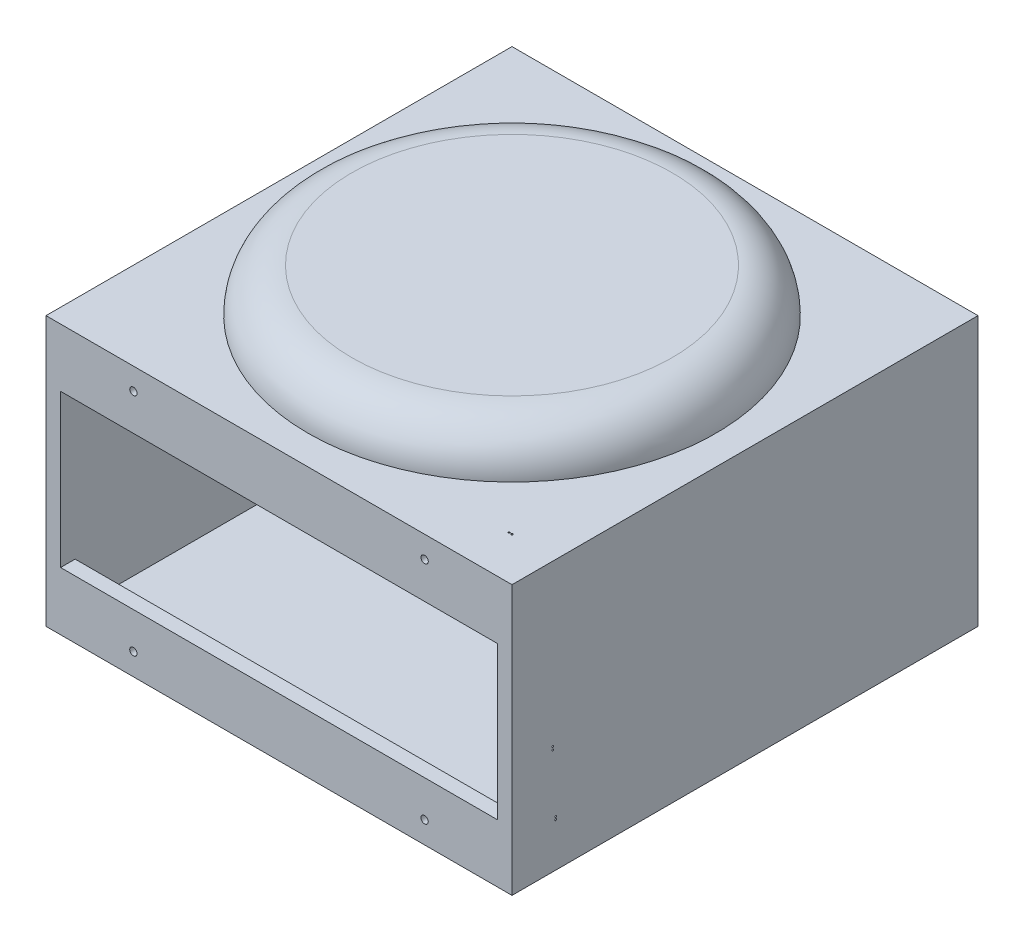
ISO-10303-21;
HEADER;
FILE_DESCRIPTION(('STEP AP214'),'2;1');
FILE_NAME('part.step','',(''),(''),'','','');
FILE_SCHEMA(('AUTOMOTIVE_DESIGN { 1 0 10303 214 1 1 1 1 }'));
ENDSEC;
DATA;
#1=APPLICATION_CONTEXT('core data for automotive mechanical design processes');
#2=APPLICATION_PROTOCOL_DEFINITION('international standard','automotive_design',2000,#1);
#3=PRODUCT_CONTEXT('',#1,'mechanical');
#4=PRODUCT('Part','Part','',(#3));
#5=PRODUCT_RELATED_PRODUCT_CATEGORY('part','',(#4));
#6=PRODUCT_DEFINITION_FORMATION('','',#4);
#7=PRODUCT_DEFINITION_CONTEXT('part definition',#1,'design');
#8=PRODUCT_DEFINITION('design','',#6,#7);
#9=PRODUCT_DEFINITION_SHAPE('','',#8);
#10=(LENGTH_UNIT() NAMED_UNIT(*) SI_UNIT(.MILLI.,.METRE.));
#11=(NAMED_UNIT(*) PLANE_ANGLE_UNIT() SI_UNIT($,.RADIAN.));
#12=(NAMED_UNIT(*) SI_UNIT($,.STERADIAN.) SOLID_ANGLE_UNIT());
#13=UNCERTAINTY_MEASURE_WITH_UNIT(LENGTH_MEASURE(1.E-05),#10,'distance_accuracy_value','');
#14=(GEOMETRIC_REPRESENTATION_CONTEXT(3) GLOBAL_UNCERTAINTY_ASSIGNED_CONTEXT((#13)) GLOBAL_UNIT_ASSIGNED_CONTEXT((#10,
#11,#12)) REPRESENTATION_CONTEXT('',''));
#15=CARTESIAN_POINT('',(0.,0.,0.));
#16=DIRECTION('',(0.,0.,1.));
#17=DIRECTION('',(1.,0.,0.));
#18=AXIS2_PLACEMENT_3D('',#15,#16,#17);
#19=CARTESIAN_POINT('',(6.34999999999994,6.35,6.34999999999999));
#20=DIRECTION('',(-1.,0.,0.));
#21=DIRECTION('',(0.,0.,1.));
#22=AXIS2_PLACEMENT_3D('',#19,#20,#21);
#23=PLANE('',#22);
#24=CARTESIAN_POINT('',(6.34999999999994,98.298,184.15));
#25=DIRECTION('',(-1.,0.,0.));
#26=DIRECTION('',(0.,0.,1.));
#27=AXIS2_PLACEMENT_3D('',#24,#25,#26);
#28=CIRCLE('',#27,0.380999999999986);
#29=CARTESIAN_POINT('',(6.34999999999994,98.298,184.531));
#30=VERTEX_POINT('',#29);
#31=EDGE_CURVE('E782',#30,#30,#28,.T.);
#32=ORIENTED_EDGE('',*,*,#31,.T.);
#33=EDGE_LOOP('',(#32));
#34=FACE_BOUND('',#33,.T.);
#35=CARTESIAN_POINT('',(6.34999999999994,97.028,184.15));
#36=DIRECTION('',(-1.,0.,0.));
#37=DIRECTION('',(0.,0.,1.));
#38=AXIS2_PLACEMENT_3D('',#35,#36,#37);
#39=CIRCLE('',#38,0.380999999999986);
#40=CARTESIAN_POINT('',(6.34999999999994,97.028,184.531));
#41=VERTEX_POINT('',#40);
#42=EDGE_CURVE('E785',#41,#41,#39,.T.);
#43=ORIENTED_EDGE('',*,*,#42,.T.);
#44=EDGE_LOOP('',(#43));
#45=FACE_BOUND('',#44,.T.);
#46=DIRECTION('',(0.,-1.,0.));
#47=VECTOR('',#46,1.);
#48=CARTESIAN_POINT('',(6.34999999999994,25.4000000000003,196.85));
#49=LINE('',#48,#47);
#50=CARTESIAN_POINT('',(6.34999999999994,25.4000000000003,196.85));
#51=VERTEX_POINT('',#50);
#52=CARTESIAN_POINT('',(6.34999999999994,6.35,196.85));
#53=VERTEX_POINT('',#52);
#54=EDGE_CURVE('E149',#51,#53,#49,.T.);
#55=ORIENTED_EDGE('',*,*,#54,.T.);
#56=DIRECTION('',(0.,0.,1.));
#57=VECTOR('',#56,1.);
#58=CARTESIAN_POINT('',(6.34999999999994,6.35,6.34999999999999));
#59=LINE('',#58,#57);
#60=CARTESIAN_POINT('',(6.34999999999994,6.35,6.34999999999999));
#61=VERTEX_POINT('',#60);
#62=EDGE_CURVE('E136',#61,#53,#59,.T.);
#63=ORIENTED_EDGE('',*,*,#62,.F.);
#64=DIRECTION('',(0.,-1.,0.));
#65=VECTOR('',#64,1.);
#66=CARTESIAN_POINT('',(6.34999999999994,6.35,6.34999999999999));
#67=LINE('',#66,#65);
#68=CARTESIAN_POINT('',(6.34999999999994,110.998,6.34999999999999));
#69=VERTEX_POINT('',#68);
#70=EDGE_CURVE('E197',#69,#61,#67,.T.);
#71=ORIENTED_EDGE('',*,*,#70,.F.);
#72=DIRECTION('',(0.,0.,1.));
#73=VECTOR('',#72,1.);
#74=CARTESIAN_POINT('',(6.34999999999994,110.998,6.34999999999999));
#75=LINE('',#74,#73);
#76=CARTESIAN_POINT('',(6.34999999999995,110.998,196.85));
#77=VERTEX_POINT('',#76);
#78=EDGE_CURVE('E214',#69,#77,#75,.T.);
#79=ORIENTED_EDGE('',*,*,#78,.T.);
#80=DIRECTION('',(0.,1.,0.));
#81=VECTOR('',#80,1.);
#82=CARTESIAN_POINT('',(6.34999999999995,91.9479999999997,196.85));
#83=LINE('',#82,#81);
#84=CARTESIAN_POINT('',(6.34999999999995,91.9479999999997,196.85));
#85=VERTEX_POINT('',#84);
#86=EDGE_CURVE('E193',#85,#77,#83,.T.);
#87=ORIENTED_EDGE('',*,*,#86,.F.);
#88=DIRECTION('',(0.,0.,-1.));
#89=VECTOR('',#88,1.);
#90=CARTESIAN_POINT('',(6.34999999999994,91.9479999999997,203.2));
#91=LINE('',#90,#89);
#92=CARTESIAN_POINT('',(6.34999999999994,91.9479999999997,203.2));
#93=VERTEX_POINT('',#92);
#94=EDGE_CURVE('E172',#93,#85,#91,.T.);
#95=ORIENTED_EDGE('',*,*,#94,.F.);
#96=DIRECTION('',(0.,-1.,0.));
#97=VECTOR('',#96,1.);
#98=CARTESIAN_POINT('',(6.34999999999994,6.35,203.2));
#99=LINE('',#98,#97);
#100=CARTESIAN_POINT('',(6.34999999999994,25.4000000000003,203.2));
#101=VERTEX_POINT('',#100);
#102=EDGE_CURVE('E196',#93,#101,#99,.T.);
#103=ORIENTED_EDGE('',*,*,#102,.T.);
#104=DIRECTION('',(0.,0.,1.));
#105=VECTOR('',#104,1.);
#106=CARTESIAN_POINT('',(6.34999999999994,25.4000000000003,203.2));
#107=LINE('',#106,#105);
#108=EDGE_CURVE('E61',#51,#101,#107,.T.);
#109=ORIENTED_EDGE('',*,*,#108,.F.);
#110=EDGE_LOOP('',(#55,#63,#71,#79,#87,#95,#103,#109));
#111=FACE_BOUND('',#110,.T.);
#112=ADVANCED_FACE('F45',(#34,#45,#111),#23,.F.);
#113=CARTESIAN_POINT('',(196.85,6.35,6.34999999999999));
#114=DIRECTION('',(1.,0.,0.));
#115=DIRECTION('',(0.,0.,-1.));
#116=AXIS2_PLACEMENT_3D('',#113,#114,#115);
#117=PLANE('',#116);
#118=CARTESIAN_POINT('',(196.85,19.05,184.15));
#119=DIRECTION('',(1.,0.,0.));
#120=DIRECTION('',(0.,0.,-1.));
#121=AXIS2_PLACEMENT_3D('',#118,#119,#120);
#122=CIRCLE('',#121,0.380999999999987);
#123=CARTESIAN_POINT('',(196.85,19.05,183.769));
#124=VERTEX_POINT('',#123);
#125=EDGE_CURVE('E819',#124,#124,#122,.T.);
#126=ORIENTED_EDGE('',*,*,#125,.T.);
#127=EDGE_LOOP('',(#126));
#128=FACE_BOUND('',#127,.T.);
#129=CARTESIAN_POINT('',(196.85,20.32,184.15));
#130=DIRECTION('',(1.,0.,0.));
#131=DIRECTION('',(0.,0.,-1.));
#132=AXIS2_PLACEMENT_3D('',#129,#130,#131);
#133=CIRCLE('',#132,0.380999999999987);
#134=CARTESIAN_POINT('',(196.85,20.32,183.769));
#135=VERTEX_POINT('',#134);
#136=EDGE_CURVE('E812',#135,#135,#133,.T.);
#137=ORIENTED_EDGE('',*,*,#136,.T.);
#138=EDGE_LOOP('',(#137));
#139=FACE_BOUND('',#138,.T.);
#140=DIRECTION('',(0.,-1.,0.));
#141=VECTOR('',#140,1.);
#142=CARTESIAN_POINT('',(196.85,25.4000000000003,196.85));
#143=LINE('',#142,#141);
#144=CARTESIAN_POINT('',(196.85,25.4000000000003,196.85));
#145=VERTEX_POINT('',#144);
#146=CARTESIAN_POINT('',(196.85,6.35,196.85));
#147=VERTEX_POINT('',#146);
#148=EDGE_CURVE('E69',#145,#147,#143,.T.);
#149=ORIENTED_EDGE('',*,*,#148,.F.);
#150=DIRECTION('',(0.,0.,-1.));
#151=VECTOR('',#150,1.);
#152=CARTESIAN_POINT('',(196.85,25.4000000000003,203.2));
#153=LINE('',#152,#151);
#154=CARTESIAN_POINT('',(196.85,25.4000000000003,203.2));
#155=VERTEX_POINT('',#154);
#156=EDGE_CURVE('E311',#155,#145,#153,.T.);
#157=ORIENTED_EDGE('',*,*,#156,.F.);
#158=DIRECTION('',(0.,1.,0.));
#159=VECTOR('',#158,1.);
#160=CARTESIAN_POINT('',(196.85,6.35,203.2));
#161=LINE('',#160,#159);
#162=CARTESIAN_POINT('',(196.85,91.9479999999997,203.2));
#163=VERTEX_POINT('',#162);
#164=EDGE_CURVE('E200',#155,#163,#161,.T.);
#165=ORIENTED_EDGE('',*,*,#164,.T.);
#166=DIRECTION('',(0.,0.,1.));
#167=VECTOR('',#166,1.);
#168=CARTESIAN_POINT('',(196.85,91.9479999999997,203.2));
#169=LINE('',#168,#167);
#170=CARTESIAN_POINT('',(196.85,91.9479999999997,196.85));
#171=VERTEX_POINT('',#170);
#172=EDGE_CURVE('E180',#171,#163,#169,.T.);
#173=ORIENTED_EDGE('',*,*,#172,.F.);
#174=DIRECTION('',(0.,1.,0.));
#175=VECTOR('',#174,1.);
#176=CARTESIAN_POINT('',(196.85,91.9479999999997,196.85));
#177=LINE('',#176,#175);
#178=CARTESIAN_POINT('',(196.85,110.998,196.85));
#179=VERTEX_POINT('',#178);
#180=EDGE_CURVE('E187',#171,#179,#177,.T.);
#181=ORIENTED_EDGE('',*,*,#180,.T.);
#182=DIRECTION('',(0.,0.,1.));
#183=VECTOR('',#182,1.);
#184=CARTESIAN_POINT('',(196.85,110.998,6.34999999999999));
#185=LINE('',#184,#183);
#186=CARTESIAN_POINT('',(196.85,110.998,6.34999999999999));
#187=VERTEX_POINT('',#186);
#188=EDGE_CURVE('E219',#187,#179,#185,.T.);
#189=ORIENTED_EDGE('',*,*,#188,.F.);
#190=DIRECTION('',(0.,1.,0.));
#191=VECTOR('',#190,1.);
#192=CARTESIAN_POINT('',(196.85,6.35,6.34999999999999));
#193=LINE('',#192,#191);
#194=CARTESIAN_POINT('',(196.85,6.35,6.34999999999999));
#195=VERTEX_POINT('',#194);
#196=EDGE_CURVE('E203',#195,#187,#193,.T.);
#197=ORIENTED_EDGE('',*,*,#196,.F.);
#198=DIRECTION('',(0.,0.,1.));
#199=VECTOR('',#198,1.);
#200=CARTESIAN_POINT('',(196.85,6.35,6.34999999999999));
#201=LINE('',#200,#199);
#202=EDGE_CURVE('E145',#195,#147,#201,.T.);
#203=ORIENTED_EDGE('',*,*,#202,.T.);
#204=EDGE_LOOP('',(#149,#157,#165,#173,#181,#189,#197,#203));
#205=FACE_BOUND('',#204,.T.);
#206=ADVANCED_FACE('F324',(#128,#139,#205),#117,.F.);
#207=CARTESIAN_POINT('',(6.34999999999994,6.35,6.34999999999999));
#208=DIRECTION('',(0.,-1.,0.));
#209=DIRECTION('',(0.,0.,-1.));
#210=AXIS2_PLACEMENT_3D('',#207,#208,#209);
#211=PLANE('',#210);
#212=CARTESIAN_POINT('',(19.05,6.35,183.692665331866));
#213=DIRECTION('',(0.,-1.,0.));
#214=DIRECTION('',(0.,0.,-1.));
#215=AXIS2_PLACEMENT_3D('',#212,#213,#214);
#216=CIRCLE('',#215,0.380999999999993);
#217=CARTESIAN_POINT('',(19.05,6.35,183.311665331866));
#218=VERTEX_POINT('',#217);
#219=EDGE_CURVE('E851',#218,#218,#216,.T.);
#220=ORIENTED_EDGE('',*,*,#219,.T.);
#221=EDGE_LOOP('',(#220));
#222=FACE_BOUND('',#221,.T.);
#223=CARTESIAN_POINT('',(20.32,6.35,183.692665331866));
#224=DIRECTION('',(0.,-1.,0.));
#225=DIRECTION('',(0.,0.,-1.));
#226=AXIS2_PLACEMENT_3D('',#223,#224,#225);
#227=CIRCLE('',#226,0.380999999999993);
#228=CARTESIAN_POINT('',(20.32,6.35,183.311665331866));
#229=VERTEX_POINT('',#228);
#230=EDGE_CURVE('E847',#229,#229,#227,.T.);
#231=ORIENTED_EDGE('',*,*,#230,.T.);
#232=EDGE_LOOP('',(#231));
#233=FACE_BOUND('',#232,.T.);
#234=CARTESIAN_POINT('',(182.88,6.35,183.692665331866));
#235=DIRECTION('',(0.,-1.,0.));
#236=DIRECTION('',(0.,0.,-1.));
#237=AXIS2_PLACEMENT_3D('',#234,#235,#236);
#238=CIRCLE('',#237,0.380999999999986);
#239=CARTESIAN_POINT('',(182.88,6.35,183.311665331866));
#240=VERTEX_POINT('',#239);
#241=EDGE_CURVE('E843',#240,#240,#238,.T.);
#242=ORIENTED_EDGE('',*,*,#241,.T.);
#243=EDGE_LOOP('',(#242));
#244=FACE_BOUND('',#243,.T.);
#245=CARTESIAN_POINT('',(184.15,6.35,183.692665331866));
#246=DIRECTION('',(0.,-1.,0.));
#247=DIRECTION('',(0.,0.,-1.));
#248=AXIS2_PLACEMENT_3D('',#245,#246,#247);
#249=CIRCLE('',#248,0.380999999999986);
#250=CARTESIAN_POINT('',(184.15,6.35,183.311665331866));
#251=VERTEX_POINT('',#250);
#252=EDGE_CURVE('E828',#251,#251,#249,.T.);
#253=ORIENTED_EDGE('',*,*,#252,.T.);
#254=EDGE_LOOP('',(#253));
#255=FACE_BOUND('',#254,.T.);
#256=DIRECTION('',(-1.,0.,0.));
#257=VECTOR('',#256,1.);
#258=CARTESIAN_POINT('',(6.34999999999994,6.35,196.85));
#259=LINE('',#258,#257);
#260=EDGE_CURVE('E139',#147,#53,#259,.T.);
#261=ORIENTED_EDGE('',*,*,#260,.F.);
#262=ORIENTED_EDGE('',*,*,#202,.F.);
#263=DIRECTION('',(1.,0.,0.));
#264=VECTOR('',#263,1.);
#265=CARTESIAN_POINT('',(6.34999999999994,6.35,6.34999999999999));
#266=LINE('',#265,#264);
#267=EDGE_CURVE('E141',#61,#195,#266,.T.);
#268=ORIENTED_EDGE('',*,*,#267,.F.);
#269=ORIENTED_EDGE('',*,*,#62,.T.);
#270=EDGE_LOOP('',(#261,#262,#268,#269));
#271=FACE_BOUND('',#270,.T.);
#272=ADVANCED_FACE('F137',(#222,#233,#244,#255,#271),#211,.F.);
#273=CARTESIAN_POINT('',(6.34999999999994,110.998,6.34999999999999));
#274=DIRECTION('',(0.,1.,0.));
#275=DIRECTION('',(0.,0.,1.));
#276=AXIS2_PLACEMENT_3D('',#273,#274,#275);
#277=PLANE('',#276);
#278=CARTESIAN_POINT('',(184.15,110.998,184.15));
#279=DIRECTION('',(0.,1.,0.));
#280=DIRECTION('',(0.,0.,1.));
#281=AXIS2_PLACEMENT_3D('',#278,#279,#280);
#282=CIRCLE('',#281,0.380999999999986);
#283=CARTESIAN_POINT('',(184.15,110.998,184.531));
#284=VERTEX_POINT('',#283);
#285=EDGE_CURVE('E803',#284,#284,#282,.T.);
#286=ORIENTED_EDGE('',*,*,#285,.T.);
#287=EDGE_LOOP('',(#286));
#288=FACE_BOUND('',#287,.T.);
#289=CARTESIAN_POINT('',(182.88,110.998,184.15));
#290=DIRECTION('',(0.,1.,0.));
#291=DIRECTION('',(0.,0.,1.));
#292=AXIS2_PLACEMENT_3D('',#289,#290,#291);
#293=CIRCLE('',#292,0.380999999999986);
#294=CARTESIAN_POINT('',(182.88,110.998,184.531));
#295=VERTEX_POINT('',#294);
#296=EDGE_CURVE('E798',#295,#295,#293,.T.);
#297=ORIENTED_EDGE('',*,*,#296,.T.);
#298=EDGE_LOOP('',(#297));
#299=FACE_BOUND('',#298,.T.);
#300=DIRECTION('',(1.,0.,0.));
#301=VECTOR('',#300,1.);
#302=CARTESIAN_POINT('',(6.34999999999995,110.998,196.85));
#303=LINE('',#302,#301);
#304=EDGE_CURVE('E171',#77,#179,#303,.T.);
#305=ORIENTED_EDGE('',*,*,#304,.F.);
#306=ORIENTED_EDGE('',*,*,#78,.F.);
#307=DIRECTION('',(-1.,0.,0.));
#308=VECTOR('',#307,1.);
#309=CARTESIAN_POINT('',(6.34999999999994,110.998,6.34999999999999));
#310=LINE('',#309,#308);
#311=EDGE_CURVE('E146',#187,#69,#310,.T.);
#312=ORIENTED_EDGE('',*,*,#311,.F.);
#313=ORIENTED_EDGE('',*,*,#188,.T.);
#314=EDGE_LOOP('',(#305,#306,#312,#313));
#315=FACE_BOUND('',#314,.T.);
#316=ADVANCED_FACE('F335',(#288,#299,#315),#277,.F.);
#317=CARTESIAN_POINT('',(0.,0.,203.2));
#318=DIRECTION('',(1.,0.,0.));
#319=DIRECTION('',(0.,1.,0.));
#320=AXIS2_PLACEMENT_3D('',#317,#318,#319);
#321=PLANE('',#320);
#322=CARTESIAN_POINT('',(0.,98.298,184.15));
#323=DIRECTION('',(-1.,0.,0.));
#324=DIRECTION('',(0.,-1.,0.));
#325=AXIS2_PLACEMENT_3D('',#322,#323,#324);
#326=CIRCLE('',#325,0.380999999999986);
#327=CARTESIAN_POINT('',(0.,97.917,184.15));
#328=VERTEX_POINT('',#327);
#329=EDGE_CURVE('E780',#328,#328,#326,.T.);
#330=ORIENTED_EDGE('',*,*,#329,.F.);
#331=EDGE_LOOP('',(#330));
#332=FACE_BOUND('',#331,.T.);
#333=CARTESIAN_POINT('',(0.,97.028,184.15));
#334=DIRECTION('',(-1.,0.,0.));
#335=DIRECTION('',(0.,-1.,0.));
#336=AXIS2_PLACEMENT_3D('',#333,#334,#335);
#337=CIRCLE('',#336,0.380999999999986);
#338=CARTESIAN_POINT('',(0.,96.647,184.15));
#339=VERTEX_POINT('',#338);
#340=EDGE_CURVE('E929',#339,#339,#337,.T.);
#341=ORIENTED_EDGE('',*,*,#340,.F.);
#342=EDGE_LOOP('',(#341));
#343=FACE_BOUND('',#342,.T.);
#344=DIRECTION('',(0.,-1.,0.));
#345=VECTOR('',#344,1.);
#346=CARTESIAN_POINT('',(0.,0.,0.));
#347=LINE('',#346,#345);
#348=CARTESIAN_POINT('',(0.,117.348,0.));
#349=VERTEX_POINT('',#348);
#350=CARTESIAN_POINT('',(0.,0.,0.));
#351=VERTEX_POINT('',#350);
#352=EDGE_CURVE('E218',#349,#351,#347,.T.);
#353=ORIENTED_EDGE('',*,*,#352,.T.);
#354=DIRECTION('',(0.,0.,-1.));
#355=VECTOR('',#354,1.);
#356=CARTESIAN_POINT('',(0.,0.,203.2));
#357=LINE('',#356,#355);
#358=CARTESIAN_POINT('',(0.,0.,203.2));
#359=VERTEX_POINT('',#358);
#360=EDGE_CURVE('E262',#359,#351,#357,.T.);
#361=ORIENTED_EDGE('',*,*,#360,.F.);
#362=DIRECTION('',(0.,-1.,0.));
#363=VECTOR('',#362,1.);
#364=CARTESIAN_POINT('',(0.,0.,203.2));
#365=LINE('',#364,#363);
#366=CARTESIAN_POINT('',(0.,117.348,203.2));
#367=VERTEX_POINT('',#366);
#368=EDGE_CURVE('E225',#367,#359,#365,.T.);
#369=ORIENTED_EDGE('',*,*,#368,.F.);
#370=DIRECTION('',(0.,0.,-1.));
#371=VECTOR('',#370,1.);
#372=CARTESIAN_POINT('',(0.,117.348,203.2));
#373=LINE('',#372,#371);
#374=EDGE_CURVE('E239',#367,#349,#373,.T.);
#375=ORIENTED_EDGE('',*,*,#374,.T.);
#376=EDGE_LOOP('',(#353,#361,#369,#375));
#377=FACE_BOUND('',#376,.T.);
#378=ADVANCED_FACE('F376',(#332,#343,#377),#321,.F.);
#379=CARTESIAN_POINT('',(0.,0.,203.2));
#380=DIRECTION('',(0.,1.,0.));
#381=DIRECTION('',(0.,0.,1.));
#382=AXIS2_PLACEMENT_3D('',#379,#380,#381);
#383=PLANE('',#382);
#384=CARTESIAN_POINT('',(19.05,0.,183.692665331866));
#385=DIRECTION('',(0.,-1.,0.));
#386=DIRECTION('',(0.,0.,-1.));
#387=AXIS2_PLACEMENT_3D('',#384,#385,#386);
#388=CIRCLE('',#387,0.380999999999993);
#389=CARTESIAN_POINT('',(19.05,0.,183.311665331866));
#390=VERTEX_POINT('',#389);
#391=EDGE_CURVE('E824',#390,#390,#388,.T.);
#392=ORIENTED_EDGE('',*,*,#391,.F.);
#393=EDGE_LOOP('',(#392));
#394=FACE_BOUND('',#393,.T.);
#395=CARTESIAN_POINT('',(20.32,0.,183.692665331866));
#396=DIRECTION('',(0.,-1.,0.));
#397=DIRECTION('',(0.,0.,-1.));
#398=AXIS2_PLACEMENT_3D('',#395,#396,#397);
#399=CIRCLE('',#398,0.380999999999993);
#400=CARTESIAN_POINT('',(20.32,0.,183.311665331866));
#401=VERTEX_POINT('',#400);
#402=EDGE_CURVE('E829',#401,#401,#399,.T.);
#403=ORIENTED_EDGE('',*,*,#402,.F.);
#404=EDGE_LOOP('',(#403));
#405=FACE_BOUND('',#404,.T.);
#406=CARTESIAN_POINT('',(182.88,0.,183.692665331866));
#407=DIRECTION('',(0.,-1.,0.));
#408=DIRECTION('',(0.,0.,-1.));
#409=AXIS2_PLACEMENT_3D('',#406,#407,#408);
#410=CIRCLE('',#409,0.380999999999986);
#411=CARTESIAN_POINT('',(182.88,0.,183.311665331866));
#412=VERTEX_POINT('',#411);
#413=EDGE_CURVE('E833',#412,#412,#410,.T.);
#414=ORIENTED_EDGE('',*,*,#413,.F.);
#415=EDGE_LOOP('',(#414));
#416=FACE_BOUND('',#415,.T.);
#417=CARTESIAN_POINT('',(184.15,0.,183.692665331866));
#418=DIRECTION('',(0.,-1.,0.));
#419=DIRECTION('',(0.,0.,-1.));
#420=AXIS2_PLACEMENT_3D('',#417,#418,#419);
#421=CIRCLE('',#420,0.380999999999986);
#422=CARTESIAN_POINT('',(184.15,0.,183.311665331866));
#423=VERTEX_POINT('',#422);
#424=EDGE_CURVE('E823',#423,#423,#421,.T.);
#425=ORIENTED_EDGE('',*,*,#424,.F.);
#426=EDGE_LOOP('',(#425));
#427=FACE_BOUND('',#426,.T.);
#428=CARTESIAN_POINT('',(101.6,0.,101.6));
#429=DIRECTION('',(0.,-1.,0.));
#430=DIRECTION('',(0.,0.,-1.));
#431=AXIS2_PLACEMENT_3D('',#428,#429,#430);
#432=CIRCLE('',#431,88.9);
#433=CARTESIAN_POINT('',(101.6,0.,12.7));
#434=VERTEX_POINT('',#433);
#435=EDGE_CURVE('E54',#434,#434,#432,.T.);
#436=ORIENTED_EDGE('',*,*,#435,.F.);
#437=EDGE_LOOP('',(#436));
#438=FACE_BOUND('',#437,.T.);
#439=DIRECTION('',(1.,0.,0.));
#440=VECTOR('',#439,1.);
#441=CARTESIAN_POINT('',(0.,0.,0.));
#442=LINE('',#441,#440);
#443=CARTESIAN_POINT('',(203.2,0.,0.));
#444=VERTEX_POINT('',#443);
#445=EDGE_CURVE('E243',#351,#444,#442,.T.);
#446=ORIENTED_EDGE('',*,*,#445,.T.);
#447=DIRECTION('',(0.,0.,-1.));
#448=VECTOR('',#447,1.);
#449=CARTESIAN_POINT('',(203.2,0.,203.2));
#450=LINE('',#449,#448);
#451=CARTESIAN_POINT('',(203.2,0.,203.2));
#452=VERTEX_POINT('',#451);
#453=EDGE_CURVE('E258',#452,#444,#450,.T.);
#454=ORIENTED_EDGE('',*,*,#453,.F.);
#455=DIRECTION('',(1.,0.,0.));
#456=VECTOR('',#455,1.);
#457=CARTESIAN_POINT('',(0.,0.,203.2));
#458=LINE('',#457,#456);
#459=EDGE_CURVE('E229',#359,#452,#458,.T.);
#460=ORIENTED_EDGE('',*,*,#459,.F.);
#461=ORIENTED_EDGE('',*,*,#360,.T.);
#462=EDGE_LOOP('',(#446,#454,#460,#461));
#463=FACE_BOUND('',#462,.T.);
#464=ADVANCED_FACE('F372',(#394,#405,#416,#427,#438,#463),#383,.F.);
#465=CARTESIAN_POINT('',(203.2,0.,203.2));
#466=DIRECTION('',(-1.,0.,0.));
#467=DIRECTION('',(0.,-1.,0.));
#468=AXIS2_PLACEMENT_3D('',#465,#466,#467);
#469=PLANE('',#468);
#470=CARTESIAN_POINT('',(203.2,19.05,184.15));
#471=DIRECTION('',(1.,0.,0.));
#472=DIRECTION('',(0.,1.,0.));
#473=AXIS2_PLACEMENT_3D('',#470,#471,#472);
#474=CIRCLE('',#473,0.380999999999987);
#475=CARTESIAN_POINT('',(203.2,19.431,184.15));
#476=VERTEX_POINT('',#475);
#477=EDGE_CURVE('E808',#476,#476,#474,.T.);
#478=ORIENTED_EDGE('',*,*,#477,.F.);
#479=EDGE_LOOP('',(#478));
#480=FACE_BOUND('',#479,.T.);
#481=CARTESIAN_POINT('',(203.2,20.32,184.15));
#482=DIRECTION('',(1.,0.,0.));
#483=DIRECTION('',(0.,1.,0.));
#484=AXIS2_PLACEMENT_3D('',#481,#482,#483);
#485=CIRCLE('',#484,0.380999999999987);
#486=CARTESIAN_POINT('',(203.2,20.701,184.15));
#487=VERTEX_POINT('',#486);
#488=EDGE_CURVE('E807',#487,#487,#485,.T.);
#489=ORIENTED_EDGE('',*,*,#488,.F.);
#490=EDGE_LOOP('',(#489));
#491=FACE_BOUND('',#490,.T.);
#492=CARTESIAN_POINT('',(203.2,47.3334352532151,185.42));
#493=DIRECTION('',(1.,0.,0.));
#494=DIRECTION('',(0.,1.,0.));
#495=AXIS2_PLACEMENT_3D('',#492,#493,#494);
#496=CIRCLE('',#495,0.380999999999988);
#497=CARTESIAN_POINT('',(203.2,47.7144352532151,185.42));
#498=VERTEX_POINT('',#497);
#499=EDGE_CURVE('E859',#498,#498,#496,.T.);
#500=ORIENTED_EDGE('',*,*,#499,.F.);
#501=EDGE_LOOP('',(#500));
#502=FACE_BOUND('',#501,.T.);
#503=CARTESIAN_POINT('',(203.2,46.0634352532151,185.42));
#504=DIRECTION('',(1.,0.,0.));
#505=DIRECTION('',(0.,1.,0.));
#506=AXIS2_PLACEMENT_3D('',#503,#504,#505);
#507=CIRCLE('',#506,0.380999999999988);
#508=CARTESIAN_POINT('',(203.2,46.4444352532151,185.42));
#509=VERTEX_POINT('',#508);
#510=EDGE_CURVE('E863',#509,#509,#507,.T.);
#511=ORIENTED_EDGE('',*,*,#510,.F.);
#512=EDGE_LOOP('',(#511));
#513=FACE_BOUND('',#512,.T.);
#514=DIRECTION('',(0.,1.,0.));
#515=VECTOR('',#514,1.);
#516=CARTESIAN_POINT('',(203.2,0.,0.));
#517=LINE('',#516,#515);
#518=CARTESIAN_POINT('',(203.2,117.348,0.));
#519=VERTEX_POINT('',#518);
#520=EDGE_CURVE('E246',#444,#519,#517,.T.);
#521=ORIENTED_EDGE('',*,*,#520,.T.);
#522=DIRECTION('',(0.,0.,-1.));
#523=VECTOR('',#522,1.);
#524=CARTESIAN_POINT('',(203.2,117.348,203.2));
#525=LINE('',#524,#523);
#526=CARTESIAN_POINT('',(203.2,117.348,203.2));
#527=VERTEX_POINT('',#526);
#528=EDGE_CURVE('E254',#527,#519,#525,.T.);
#529=ORIENTED_EDGE('',*,*,#528,.F.);
#530=DIRECTION('',(0.,1.,0.));
#531=VECTOR('',#530,1.);
#532=CARTESIAN_POINT('',(203.2,0.,203.2));
#533=LINE('',#532,#531);
#534=EDGE_CURVE('E233',#452,#527,#533,.T.);
#535=ORIENTED_EDGE('',*,*,#534,.F.);
#536=ORIENTED_EDGE('',*,*,#453,.T.);
#537=EDGE_LOOP('',(#521,#529,#535,#536));
#538=FACE_BOUND('',#537,.T.);
#539=ADVANCED_FACE('F368',(#480,#491,#502,#513,#538),#469,.F.);
#540=CARTESIAN_POINT('',(0.,117.348,203.2));
#541=DIRECTION('',(0.,-1.,0.));
#542=DIRECTION('',(0.,0.,-1.));
#543=AXIS2_PLACEMENT_3D('',#540,#541,#542);
#544=PLANE('',#543);
#545=CARTESIAN_POINT('',(184.15,117.348,184.15));
#546=DIRECTION('',(0.,1.,0.));
#547=DIRECTION('',(0.,0.,1.));
#548=AXIS2_PLACEMENT_3D('',#545,#546,#547);
#549=CIRCLE('',#548,0.380999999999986);
#550=CARTESIAN_POINT('',(184.15,117.348,184.531));
#551=VERTEX_POINT('',#550);
#552=EDGE_CURVE('E790',#551,#551,#549,.T.);
#553=ORIENTED_EDGE('',*,*,#552,.F.);
#554=EDGE_LOOP('',(#553));
#555=FACE_BOUND('',#554,.T.);
#556=CARTESIAN_POINT('',(182.88,117.348,184.15));
#557=DIRECTION('',(0.,1.,0.));
#558=DIRECTION('',(0.,0.,1.));
#559=AXIS2_PLACEMENT_3D('',#556,#557,#558);
#560=CIRCLE('',#559,0.380999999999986);
#561=CARTESIAN_POINT('',(182.88,117.348,184.531));
#562=VERTEX_POINT('',#561);
#563=EDGE_CURVE('E784',#562,#562,#560,.T.);
#564=ORIENTED_EDGE('',*,*,#563,.F.);
#565=EDGE_LOOP('',(#564));
#566=FACE_BOUND('',#565,.T.);
#567=CARTESIAN_POINT('',(101.6,117.348,101.6));
#568=DIRECTION('',(0.,1.,0.));
#569=DIRECTION('',(0.,0.,1.));
#570=AXIS2_PLACEMENT_3D('',#567,#568,#569);
#571=CIRCLE('',#570,88.9);
#572=CARTESIAN_POINT('',(101.6,117.348,190.5));
#573=VERTEX_POINT('',#572);
#574=EDGE_CURVE('E265',#573,#573,#571,.T.);
#575=ORIENTED_EDGE('',*,*,#574,.F.);
#576=EDGE_LOOP('',(#575));
#577=FACE_BOUND('',#576,.T.);
#578=DIRECTION('',(-1.,0.,0.));
#579=VECTOR('',#578,1.);
#580=CARTESIAN_POINT('',(0.,117.348,0.));
#581=LINE('',#580,#579);
#582=EDGE_CURVE('E230',#519,#349,#581,.T.);
#583=ORIENTED_EDGE('',*,*,#582,.T.);
#584=ORIENTED_EDGE('',*,*,#374,.F.);
#585=DIRECTION('',(-1.,0.,0.));
#586=VECTOR('',#585,1.);
#587=CARTESIAN_POINT('',(0.,117.348,203.2));
#588=LINE('',#587,#586);
#589=EDGE_CURVE('E236',#527,#367,#588,.T.);
#590=ORIENTED_EDGE('',*,*,#589,.F.);
#591=ORIENTED_EDGE('',*,*,#528,.T.);
#592=EDGE_LOOP('',(#583,#584,#590,#591));
#593=FACE_BOUND('',#592,.T.);
#594=ADVANCED_FACE('F363',(#555,#566,#577,#593),#544,.F.);
#595=CARTESIAN_POINT('',(0.,0.,203.2));
#596=DIRECTION('',(0.,0.,-1.));
#597=DIRECTION('',(-1.,0.,0.));
#598=AXIS2_PLACEMENT_3D('',#595,#596,#597);
#599=PLANE('',#598);
#600=CARTESIAN_POINT('',(38.0999999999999,9.52499999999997,203.2));
#601=DIRECTION('',(0.,0.,1.));
#602=DIRECTION('',(1.,0.,0.));
#603=AXIS2_PLACEMENT_3D('',#600,#601,#602);
#604=CIRCLE('',#603,1.5875);
#605=CARTESIAN_POINT('',(39.6874999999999,9.52499999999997,203.2));
#606=VERTEX_POINT('',#605);
#607=EDGE_CURVE('E298',#606,#606,#604,.T.);
#608=ORIENTED_EDGE('',*,*,#607,.F.);
#609=EDGE_LOOP('',(#608));
#610=FACE_BOUND('',#609,.T.);
#611=CARTESIAN_POINT('',(165.1,9.52500000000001,203.2));
#612=DIRECTION('',(0.,0.,1.));
#613=DIRECTION('',(1.,0.,0.));
#614=AXIS2_PLACEMENT_3D('',#611,#612,#613);
#615=CIRCLE('',#614,1.58749999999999);
#616=CARTESIAN_POINT('',(166.6875,9.52500000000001,203.2));
#617=VERTEX_POINT('',#616);
#618=EDGE_CURVE('E290',#617,#617,#615,.T.);
#619=ORIENTED_EDGE('',*,*,#618,.F.);
#620=EDGE_LOOP('',(#619));
#621=FACE_BOUND('',#620,.T.);
#622=CARTESIAN_POINT('',(165.1,107.823,203.2));
#623=DIRECTION('',(0.,0.,1.));
#624=DIRECTION('',(1.,0.,0.));
#625=AXIS2_PLACEMENT_3D('',#622,#623,#624);
#626=CIRCLE('',#625,1.58749999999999);
#627=CARTESIAN_POINT('',(166.6875,107.823,203.2));
#628=VERTEX_POINT('',#627);
#629=EDGE_CURVE('E281',#628,#628,#626,.T.);
#630=ORIENTED_EDGE('',*,*,#629,.F.);
#631=EDGE_LOOP('',(#630));
#632=FACE_BOUND('',#631,.T.);
#633=CARTESIAN_POINT('',(38.0999999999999,107.823,203.2));
#634=DIRECTION('',(0.,0.,1.));
#635=DIRECTION('',(1.,0.,0.));
#636=AXIS2_PLACEMENT_3D('',#633,#634,#635);
#637=CIRCLE('',#636,1.5875);
#638=CARTESIAN_POINT('',(39.6874999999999,107.823,203.2));
#639=VERTEX_POINT('',#638);
#640=EDGE_CURVE('E157',#639,#639,#637,.T.);
#641=ORIENTED_EDGE('',*,*,#640,.F.);
#642=EDGE_LOOP('',(#641));
#643=FACE_BOUND('',#642,.T.);
#644=ORIENTED_EDGE('',*,*,#164,.F.);
#645=DIRECTION('',(1.,0.,0.));
#646=VECTOR('',#645,1.);
#647=CARTESIAN_POINT('',(6.34999999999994,25.4000000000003,203.2));
#648=LINE('',#647,#646);
#649=EDGE_CURVE('E161',#101,#155,#648,.T.);
#650=ORIENTED_EDGE('',*,*,#649,.F.);
#651=ORIENTED_EDGE('',*,*,#102,.F.);
#652=DIRECTION('',(-1.,0.,0.));
#653=VECTOR('',#652,1.);
#654=CARTESIAN_POINT('',(6.34999999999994,91.9479999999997,203.2));
#655=LINE('',#654,#653);
#656=EDGE_CURVE('E184',#163,#93,#655,.T.);
#657=ORIENTED_EDGE('',*,*,#656,.F.);
#658=EDGE_LOOP('',(#644,#650,#651,#657));
#659=FACE_BOUND('',#658,.T.);
#660=ORIENTED_EDGE('',*,*,#368,.T.);
#661=ORIENTED_EDGE('',*,*,#459,.T.);
#662=ORIENTED_EDGE('',*,*,#534,.T.);
#663=ORIENTED_EDGE('',*,*,#589,.T.);
#664=EDGE_LOOP('',(#660,#661,#662,#663));
#665=FACE_BOUND('',#664,.T.);
#666=ADVANCED_FACE('F320',(#610,#621,#632,#643,#659,#665),#599,.F.);
#667=CARTESIAN_POINT('',(0.,0.,0.));
#668=DIRECTION('',(0.,0.,-1.));
#669=DIRECTION('',(-1.,0.,0.));
#670=AXIS2_PLACEMENT_3D('',#667,#668,#669);
#671=PLANE('',#670);
#672=ORIENTED_EDGE('',*,*,#352,.F.);
#673=ORIENTED_EDGE('',*,*,#582,.F.);
#674=ORIENTED_EDGE('',*,*,#520,.F.);
#675=ORIENTED_EDGE('',*,*,#445,.F.);
#676=EDGE_LOOP('',(#672,#673,#674,#675));
#677=FACE_BOUND('',#676,.T.);
#678=ADVANCED_FACE('F339',(#677),#671,.T.);
#679=CARTESIAN_POINT('',(0.,0.,6.34999999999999));
#680=DIRECTION('',(0.,0.,-1.));
#681=DIRECTION('',(-1.,0.,0.));
#682=AXIS2_PLACEMENT_3D('',#679,#680,#681);
#683=PLANE('',#682);
#684=ORIENTED_EDGE('',*,*,#70,.T.);
#685=ORIENTED_EDGE('',*,*,#267,.T.);
#686=ORIENTED_EDGE('',*,*,#196,.T.);
#687=ORIENTED_EDGE('',*,*,#311,.T.);
#688=EDGE_LOOP('',(#684,#685,#686,#687));
#689=FACE_BOUND('',#688,.T.);
#690=ADVANCED_FACE('F337',(#689),#683,.F.);
#691=CARTESIAN_POINT('',(6.34999999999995,91.9479999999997,196.85));
#692=DIRECTION('',(0.,0.,1.));
#693=DIRECTION('',(1.,0.,0.));
#694=AXIS2_PLACEMENT_3D('',#691,#692,#693);
#695=PLANE('',#694);
#696=CARTESIAN_POINT('',(165.1,107.823,196.85));
#697=DIRECTION('',(0.,0.,1.));
#698=DIRECTION('',(1.,0.,0.));
#699=AXIS2_PLACEMENT_3D('',#696,#697,#698);
#700=CIRCLE('',#699,1.58749999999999);
#701=CARTESIAN_POINT('',(166.6875,107.823,196.85));
#702=VERTEX_POINT('',#701);
#703=EDGE_CURVE('E285',#702,#702,#700,.F.);
#704=ORIENTED_EDGE('',*,*,#703,.F.);
#705=EDGE_LOOP('',(#704));
#706=FACE_BOUND('',#705,.T.);
#707=CARTESIAN_POINT('',(38.0999999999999,107.823,196.85));
#708=DIRECTION('',(0.,0.,1.));
#709=DIRECTION('',(1.,0.,0.));
#710=AXIS2_PLACEMENT_3D('',#707,#708,#709);
#711=CIRCLE('',#710,1.5875);
#712=CARTESIAN_POINT('',(39.6874999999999,107.823,196.85));
#713=VERTEX_POINT('',#712);
#714=EDGE_CURVE('E164',#713,#713,#711,.F.);
#715=ORIENTED_EDGE('',*,*,#714,.F.);
#716=EDGE_LOOP('',(#715));
#717=FACE_BOUND('',#716,.T.);
#718=ORIENTED_EDGE('',*,*,#304,.T.);
#719=ORIENTED_EDGE('',*,*,#180,.F.);
#720=DIRECTION('',(1.,0.,0.));
#721=VECTOR('',#720,1.);
#722=CARTESIAN_POINT('',(6.34999999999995,91.9479999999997,196.85));
#723=LINE('',#722,#721);
#724=EDGE_CURVE('E176',#85,#171,#723,.T.);
#725=ORIENTED_EDGE('',*,*,#724,.F.);
#726=ORIENTED_EDGE('',*,*,#86,.T.);
#727=EDGE_LOOP('',(#718,#719,#725,#726));
#728=FACE_BOUND('',#727,.T.);
#729=ADVANCED_FACE('F330',(#706,#717,#728),#695,.F.);
#730=CARTESIAN_POINT('',(0.,91.9479999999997,0.));
#731=DIRECTION('',(0.,-1.,0.));
#732=DIRECTION('',(0.,0.,-1.));
#733=AXIS2_PLACEMENT_3D('',#730,#731,#732);
#734=PLANE('',#733);
#735=ORIENTED_EDGE('',*,*,#94,.T.);
#736=ORIENTED_EDGE('',*,*,#724,.T.);
#737=ORIENTED_EDGE('',*,*,#172,.T.);
#738=ORIENTED_EDGE('',*,*,#656,.T.);
#739=EDGE_LOOP('',(#735,#736,#737,#738));
#740=FACE_BOUND('',#739,.T.);
#741=ADVANCED_FACE('F326',(#740),#734,.T.);
#742=CARTESIAN_POINT('',(6.34999999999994,25.4000000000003,196.85));
#743=DIRECTION('',(0.,0.,1.));
#744=DIRECTION('',(1.,0.,0.));
#745=AXIS2_PLACEMENT_3D('',#742,#743,#744);
#746=PLANE('',#745);
#747=CARTESIAN_POINT('',(38.0999999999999,9.52499999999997,196.85));
#748=DIRECTION('',(0.,0.,1.));
#749=DIRECTION('',(1.,0.,0.));
#750=AXIS2_PLACEMENT_3D('',#747,#748,#749);
#751=CIRCLE('',#750,1.5875);
#752=CARTESIAN_POINT('',(39.6874999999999,9.52499999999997,196.85));
#753=VERTEX_POINT('',#752);
#754=EDGE_CURVE('E294',#753,#753,#751,.F.);
#755=ORIENTED_EDGE('',*,*,#754,.F.);
#756=EDGE_LOOP('',(#755));
#757=FACE_BOUND('',#756,.T.);
#758=CARTESIAN_POINT('',(165.1,9.52500000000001,196.85));
#759=DIRECTION('',(0.,0.,1.));
#760=DIRECTION('',(1.,0.,0.));
#761=AXIS2_PLACEMENT_3D('',#758,#759,#760);
#762=CIRCLE('',#761,1.58749999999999);
#763=CARTESIAN_POINT('',(166.6875,9.52500000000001,196.85));
#764=VERTEX_POINT('',#763);
#765=EDGE_CURVE('E286',#764,#764,#762,.F.);
#766=ORIENTED_EDGE('',*,*,#765,.F.);
#767=EDGE_LOOP('',(#766));
#768=FACE_BOUND('',#767,.T.);
#769=ORIENTED_EDGE('',*,*,#260,.T.);
#770=ORIENTED_EDGE('',*,*,#54,.F.);
#771=DIRECTION('',(-1.,0.,0.));
#772=VECTOR('',#771,1.);
#773=CARTESIAN_POINT('',(6.34999999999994,25.4000000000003,196.85));
#774=LINE('',#773,#772);
#775=EDGE_CURVE('E153',#145,#51,#774,.T.);
#776=ORIENTED_EDGE('',*,*,#775,.F.);
#777=ORIENTED_EDGE('',*,*,#148,.T.);
#778=EDGE_LOOP('',(#769,#770,#776,#777));
#779=FACE_BOUND('',#778,.T.);
#780=ADVANCED_FACE('F155',(#757,#768,#779),#746,.F.);
#781=CARTESIAN_POINT('',(0.,25.4000000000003,0.));
#782=DIRECTION('',(0.,-1.,0.));
#783=DIRECTION('',(0.,0.,-1.));
#784=AXIS2_PLACEMENT_3D('',#781,#782,#783);
#785=PLANE('',#784);
#786=ORIENTED_EDGE('',*,*,#108,.T.);
#787=ORIENTED_EDGE('',*,*,#649,.T.);
#788=ORIENTED_EDGE('',*,*,#156,.T.);
#789=ORIENTED_EDGE('',*,*,#775,.T.);
#790=EDGE_LOOP('',(#786,#787,#788,#789));
#791=FACE_BOUND('',#790,.T.);
#792=ADVANCED_FACE('F315',(#791),#785,.F.);
#793=CARTESIAN_POINT('',(165.1,9.52500000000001,-0.001000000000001));
#794=DIRECTION('',(0.,0.,1.));
#795=DIRECTION('',(1.,0.,0.));
#796=AXIS2_PLACEMENT_3D('',#793,#794,#795);
#797=CYLINDRICAL_SURFACE('',#796,1.58749999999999);
#798=ORIENTED_EDGE('',*,*,#618,.T.);
#799=EDGE_LOOP('',(#798));
#800=FACE_BOUND('',#799,.T.);
#801=ORIENTED_EDGE('',*,*,#765,.T.);
#802=EDGE_LOOP('',(#801));
#803=FACE_BOUND('',#802,.T.);
#804=ADVANCED_FACE('F401',(#800,#803),#797,.F.);
#805=CARTESIAN_POINT('',(38.0999999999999,9.52499999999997,-0.001000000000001));
#806=DIRECTION('',(0.,0.,1.));
#807=DIRECTION('',(1.,0.,0.));
#808=AXIS2_PLACEMENT_3D('',#805,#806,#807);
#809=CYLINDRICAL_SURFACE('',#808,1.5875);
#810=ORIENTED_EDGE('',*,*,#607,.T.);
#811=EDGE_LOOP('',(#810));
#812=FACE_BOUND('',#811,.T.);
#813=ORIENTED_EDGE('',*,*,#754,.T.);
#814=EDGE_LOOP('',(#813));
#815=FACE_BOUND('',#814,.T.);
#816=ADVANCED_FACE('F404',(#812,#815),#809,.F.);
#817=CARTESIAN_POINT('',(38.0999999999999,107.823,-0.001000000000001));
#818=DIRECTION('',(0.,0.,1.));
#819=DIRECTION('',(1.,0.,0.));
#820=AXIS2_PLACEMENT_3D('',#817,#818,#819);
#821=CYLINDRICAL_SURFACE('',#820,1.5875);
#822=ORIENTED_EDGE('',*,*,#640,.T.);
#823=EDGE_LOOP('',(#822));
#824=FACE_BOUND('',#823,.T.);
#825=ORIENTED_EDGE('',*,*,#714,.T.);
#826=EDGE_LOOP('',(#825));
#827=FACE_BOUND('',#826,.T.);
#828=ADVANCED_FACE('F396',(#824,#827),#821,.F.);
#829=CARTESIAN_POINT('',(165.1,107.823,-0.001000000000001));
#830=DIRECTION('',(0.,0.,1.));
#831=DIRECTION('',(1.,0.,0.));
#832=AXIS2_PLACEMENT_3D('',#829,#830,#831);
#833=CYLINDRICAL_SURFACE('',#832,1.58749999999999);
#834=ORIENTED_EDGE('',*,*,#629,.T.);
#835=EDGE_LOOP('',(#834));
#836=FACE_BOUND('',#835,.T.);
#837=ORIENTED_EDGE('',*,*,#703,.T.);
#838=EDGE_LOOP('',(#837));
#839=FACE_BOUND('',#838,.T.);
#840=ADVANCED_FACE('F390',(#836,#839),#833,.F.);
#841=CARTESIAN_POINT('',(101.6,136.398,101.6));
#842=DIRECTION('',(0.,1.,0.));
#843=DIRECTION('',(0.,0.,1.));
#844=AXIS2_PLACEMENT_3D('',#841,#842,#843);
#845=PLANE('',#844);
#846=CARTESIAN_POINT('',(101.6,136.398,101.6));
#847=DIRECTION('',(0.,1.,0.));
#848=DIRECTION('',(0.,0.,1.));
#849=AXIS2_PLACEMENT_3D('',#846,#847,#848);
#850=CIRCLE('',#849,69.85);
#851=CARTESIAN_POINT('',(101.6,136.398,171.45));
#852=VERTEX_POINT('',#851);
#853=EDGE_CURVE('E266',#852,#852,#850,.T.);
#854=ORIENTED_EDGE('',*,*,#853,.T.);
#855=EDGE_LOOP('',(#854));
#856=FACE_BOUND('',#855,.T.);
#857=ADVANCED_FACE('F383',(#856),#845,.T.);
#858=CARTESIAN_POINT('',(101.6,117.348,101.6));
#859=DIRECTION('',(0.,1.,0.));
#860=DIRECTION('',(0.,0.,1.));
#861=AXIS2_PLACEMENT_3D('',#858,#859,#860);
#862=TOROIDAL_SURFACE('',#861,69.85,19.05);
#863=ORIENTED_EDGE('',*,*,#574,.T.);
#864=EDGE_LOOP('',(#863));
#865=FACE_BOUND('',#864,.T.);
#866=ORIENTED_EDGE('',*,*,#853,.F.);
#867=EDGE_LOOP('',(#866));
#868=FACE_BOUND('',#867,.T.);
#869=ADVANCED_FACE('F380',(#865,#868),#862,.T.);
#870=CARTESIAN_POINT('',(101.6,-19.05,101.6));
#871=DIRECTION('',(0.,-1.,0.));
#872=DIRECTION('',(0.,0.,-1.));
#873=AXIS2_PLACEMENT_3D('',#870,#871,#872);
#874=PLANE('',#873);
#875=CARTESIAN_POINT('',(101.6,-19.05,101.6));
#876=DIRECTION('',(0.,-1.,0.));
#877=DIRECTION('',(0.,0.,-1.));
#878=AXIS2_PLACEMENT_3D('',#875,#876,#877);
#879=CIRCLE('',#878,69.85);
#880=CARTESIAN_POINT('',(101.6,-19.05,31.75));
#881=VERTEX_POINT('',#880);
#882=EDGE_CURVE('E11',#881,#881,#879,.T.);
#883=ORIENTED_EDGE('',*,*,#882,.T.);
#884=EDGE_LOOP('',(#883));
#885=FACE_BOUND('',#884,.T.);
#886=ADVANCED_FACE('F382',(#885),#874,.T.);
#887=CARTESIAN_POINT('',(101.6,0.,101.6));
#888=DIRECTION('',(0.,-1.,0.));
#889=DIRECTION('',(0.,0.,-1.));
#890=AXIS2_PLACEMENT_3D('',#887,#888,#889);
#891=TOROIDAL_SURFACE('',#890,69.85,19.05);
#892=ORIENTED_EDGE('',*,*,#435,.T.);
#893=EDGE_LOOP('',(#892));
#894=FACE_BOUND('',#893,.T.);
#895=ORIENTED_EDGE('',*,*,#882,.F.);
#896=EDGE_LOOP('',(#895));
#897=FACE_BOUND('',#896,.T.);
#898=ADVANCED_FACE('F47',(#894,#897),#891,.T.);
#899=CARTESIAN_POINT('',(199.39,46.0634352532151,185.42));
#900=DIRECTION('',(1.,0.,0.));
#901=DIRECTION('',(0.,1.,0.));
#902=AXIS2_PLACEMENT_3D('',#899,#900,#901);
#903=CYLINDRICAL_SURFACE('',#902,0.380999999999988);
#904=CARTESIAN_POINT('',(199.39,46.0634352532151,185.42));
#905=DIRECTION('',(1.,0.,0.));
#906=DIRECTION('',(0.,1.,0.));
#907=AXIS2_PLACEMENT_3D('',#904,#905,#906);
#908=CIRCLE('',#907,0.380999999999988);
#909=CARTESIAN_POINT('',(199.39,46.4444352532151,185.42));
#910=VERTEX_POINT('',#909);
#911=EDGE_CURVE('E855',#910,#910,#908,.T.);
#912=ORIENTED_EDGE('',*,*,#911,.F.);
#913=EDGE_LOOP('',(#912));
#914=FACE_BOUND('',#913,.T.);
#915=ORIENTED_EDGE('',*,*,#510,.T.);
#916=EDGE_LOOP('',(#915));
#917=FACE_BOUND('',#916,.T.);
#918=ADVANCED_FACE('F478',(#914,#917),#903,.F.);
#919=CARTESIAN_POINT('',(199.39,46.0634352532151,185.42));
#920=DIRECTION('',(1.,0.,0.));
#921=DIRECTION('',(0.,1.,0.));
#922=AXIS2_PLACEMENT_3D('',#919,#920,#921);
#923=PLANE('',#922);
#924=ORIENTED_EDGE('',*,*,#911,.T.);
#925=EDGE_LOOP('',(#924));
#926=FACE_BOUND('',#925,.T.);
#927=ADVANCED_FACE('F488',(#926),#923,.T.);
#928=CARTESIAN_POINT('',(199.39,47.3334352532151,185.42));
#929=DIRECTION('',(1.,0.,0.));
#930=DIRECTION('',(0.,1.,0.));
#931=AXIS2_PLACEMENT_3D('',#928,#929,#930);
#932=CYLINDRICAL_SURFACE('',#931,0.380999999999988);
#933=CARTESIAN_POINT('',(199.39,47.3334352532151,185.42));
#934=DIRECTION('',(1.,0.,0.));
#935=DIRECTION('',(0.,1.,0.));
#936=AXIS2_PLACEMENT_3D('',#933,#934,#935);
#937=CIRCLE('',#936,0.380999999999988);
#938=CARTESIAN_POINT('',(199.39,47.7144352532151,185.42));
#939=VERTEX_POINT('',#938);
#940=EDGE_CURVE('E302',#939,#939,#937,.T.);
#941=ORIENTED_EDGE('',*,*,#940,.F.);
#942=EDGE_LOOP('',(#941));
#943=FACE_BOUND('',#942,.T.);
#944=ORIENTED_EDGE('',*,*,#499,.T.);
#945=EDGE_LOOP('',(#944));
#946=FACE_BOUND('',#945,.T.);
#947=ADVANCED_FACE('F499',(#943,#946),#932,.F.);
#948=CARTESIAN_POINT('',(199.39,47.3334352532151,185.42));
#949=DIRECTION('',(1.,0.,0.));
#950=DIRECTION('',(0.,1.,0.));
#951=AXIS2_PLACEMENT_3D('',#948,#949,#950);
#952=PLANE('',#951);
#953=ORIENTED_EDGE('',*,*,#940,.T.);
#954=EDGE_LOOP('',(#953));
#955=FACE_BOUND('',#954,.T.);
#956=ADVANCED_FACE('F509',(#955),#952,.T.);
#957=CARTESIAN_POINT('',(184.15,7.62,183.692665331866));
#958=DIRECTION('',(0.,-1.,0.));
#959=DIRECTION('',(0.,0.,-1.));
#960=AXIS2_PLACEMENT_3D('',#957,#958,#959);
#961=CYLINDRICAL_SURFACE('',#960,0.380999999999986);
#962=ORIENTED_EDGE('',*,*,#424,.T.);
#963=EDGE_LOOP('',(#962));
#964=FACE_BOUND('',#963,.T.);
#965=ORIENTED_EDGE('',*,*,#252,.F.);
#966=EDGE_LOOP('',(#965));
#967=FACE_BOUND('',#966,.T.);
#968=ADVANCED_FACE('F520',(#964,#967),#961,.F.);
#969=CARTESIAN_POINT('',(182.88,7.62,183.692665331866));
#970=DIRECTION('',(0.,-1.,0.));
#971=DIRECTION('',(0.,0.,-1.));
#972=AXIS2_PLACEMENT_3D('',#969,#970,#971);
#973=CYLINDRICAL_SURFACE('',#972,0.380999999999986);
#974=ORIENTED_EDGE('',*,*,#413,.T.);
#975=EDGE_LOOP('',(#974));
#976=FACE_BOUND('',#975,.T.);
#977=ORIENTED_EDGE('',*,*,#241,.F.);
#978=EDGE_LOOP('',(#977));
#979=FACE_BOUND('',#978,.T.);
#980=ADVANCED_FACE('F551',(#976,#979),#973,.F.);
#981=CARTESIAN_POINT('',(20.32,7.62,183.692665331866));
#982=DIRECTION('',(0.,-1.,0.));
#983=DIRECTION('',(0.,0.,-1.));
#984=AXIS2_PLACEMENT_3D('',#981,#982,#983);
#985=CYLINDRICAL_SURFACE('',#984,0.380999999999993);
#986=ORIENTED_EDGE('',*,*,#402,.T.);
#987=EDGE_LOOP('',(#986));
#988=FACE_BOUND('',#987,.T.);
#989=ORIENTED_EDGE('',*,*,#230,.F.);
#990=EDGE_LOOP('',(#989));
#991=FACE_BOUND('',#990,.T.);
#992=ADVANCED_FACE('F562',(#988,#991),#985,.F.);
#993=CARTESIAN_POINT('',(19.05,7.62,183.692665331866));
#994=DIRECTION('',(0.,-1.,0.));
#995=DIRECTION('',(0.,0.,-1.));
#996=AXIS2_PLACEMENT_3D('',#993,#994,#995);
#997=CYLINDRICAL_SURFACE('',#996,0.380999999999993);
#998=ORIENTED_EDGE('',*,*,#391,.T.);
#999=EDGE_LOOP('',(#998));
#1000=FACE_BOUND('',#999,.T.);
#1001=ORIENTED_EDGE('',*,*,#219,.F.);
#1002=EDGE_LOOP('',(#1001));
#1003=FACE_BOUND('',#1002,.T.);
#1004=ADVANCED_FACE('F573',(#1000,#1003),#997,.F.);
#1005=CARTESIAN_POINT('',(195.58,20.32,184.15));
#1006=DIRECTION('',(1.,0.,0.));
#1007=DIRECTION('',(0.,1.,0.));
#1008=AXIS2_PLACEMENT_3D('',#1005,#1006,#1007);
#1009=CYLINDRICAL_SURFACE('',#1008,0.380999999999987);
#1010=ORIENTED_EDGE('',*,*,#488,.T.);
#1011=EDGE_LOOP('',(#1010));
#1012=FACE_BOUND('',#1011,.T.);
#1013=ORIENTED_EDGE('',*,*,#136,.F.);
#1014=EDGE_LOOP('',(#1013));
#1015=FACE_BOUND('',#1014,.T.);
#1016=ADVANCED_FACE('F584',(#1012,#1015),#1009,.F.);
#1017=CARTESIAN_POINT('',(195.58,19.05,184.15));
#1018=DIRECTION('',(1.,0.,0.));
#1019=DIRECTION('',(0.,1.,0.));
#1020=AXIS2_PLACEMENT_3D('',#1017,#1018,#1019);
#1021=CYLINDRICAL_SURFACE('',#1020,0.380999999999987);
#1022=ORIENTED_EDGE('',*,*,#477,.T.);
#1023=EDGE_LOOP('',(#1022));
#1024=FACE_BOUND('',#1023,.T.);
#1025=ORIENTED_EDGE('',*,*,#125,.F.);
#1026=EDGE_LOOP('',(#1025));
#1027=FACE_BOUND('',#1026,.T.);
#1028=ADVANCED_FACE('F609',(#1024,#1027),#1021,.F.);
#1029=CARTESIAN_POINT('',(182.88,109.728,184.15));
#1030=DIRECTION('',(0.,1.,0.));
#1031=DIRECTION('',(0.,0.,1.));
#1032=AXIS2_PLACEMENT_3D('',#1029,#1030,#1031);
#1033=CYLINDRICAL_SURFACE('',#1032,0.380999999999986);
#1034=ORIENTED_EDGE('',*,*,#563,.T.);
#1035=EDGE_LOOP('',(#1034));
#1036=FACE_BOUND('',#1035,.T.);
#1037=ORIENTED_EDGE('',*,*,#296,.F.);
#1038=EDGE_LOOP('',(#1037));
#1039=FACE_BOUND('',#1038,.T.);
#1040=ADVANCED_FACE('F620',(#1036,#1039),#1033,.F.);
#1041=CARTESIAN_POINT('',(184.15,109.728,184.15));
#1042=DIRECTION('',(0.,1.,0.));
#1043=DIRECTION('',(0.,0.,1.));
#1044=AXIS2_PLACEMENT_3D('',#1041,#1042,#1043);
#1045=CYLINDRICAL_SURFACE('',#1044,0.380999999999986);
#1046=ORIENTED_EDGE('',*,*,#552,.T.);
#1047=EDGE_LOOP('',(#1046));
#1048=FACE_BOUND('',#1047,.T.);
#1049=ORIENTED_EDGE('',*,*,#285,.F.);
#1050=EDGE_LOOP('',(#1049));
#1051=FACE_BOUND('',#1050,.T.);
#1052=ADVANCED_FACE('F647',(#1048,#1051),#1045,.F.);
#1053=CARTESIAN_POINT('',(7.61999999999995,97.028,184.15));
#1054=DIRECTION('',(-1.,0.,0.));
#1055=DIRECTION('',(0.,-1.,0.));
#1056=AXIS2_PLACEMENT_3D('',#1053,#1054,#1055);
#1057=CYLINDRICAL_SURFACE('',#1056,0.380999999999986);
#1058=ORIENTED_EDGE('',*,*,#340,.T.);
#1059=EDGE_LOOP('',(#1058));
#1060=FACE_BOUND('',#1059,.T.);
#1061=ORIENTED_EDGE('',*,*,#42,.F.);
#1062=EDGE_LOOP('',(#1061));
#1063=FACE_BOUND('',#1062,.T.);
#1064=ADVANCED_FACE('F657',(#1060,#1063),#1057,.F.);
#1065=CARTESIAN_POINT('',(7.61999999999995,98.298,184.15));
#1066=DIRECTION('',(-1.,0.,0.));
#1067=DIRECTION('',(0.,-1.,0.));
#1068=AXIS2_PLACEMENT_3D('',#1065,#1066,#1067);
#1069=CYLINDRICAL_SURFACE('',#1068,0.380999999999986);
#1070=ORIENTED_EDGE('',*,*,#329,.T.);
#1071=EDGE_LOOP('',(#1070));
#1072=FACE_BOUND('',#1071,.T.);
#1073=ORIENTED_EDGE('',*,*,#31,.F.);
#1074=EDGE_LOOP('',(#1073));
#1075=FACE_BOUND('',#1074,.T.);
#1076=ADVANCED_FACE('F680',(#1072,#1075),#1069,.F.);
#1077=CLOSED_SHELL('',(#112,#206,#272,#316,#378,#464,#539,#594,#666,#678,#690,#729,#741,#780,
#792,#804,#816,#828,#840,#857,#869,#886,#898,#918,#927,#947,#956,#968,#980,#992,#1004,#1016,
#1028,#1040,#1052,#1064,#1076));
#1078=MANIFOLD_SOLID_BREP('B2',#1077);
#1079=ADVANCED_BREP_SHAPE_REPRESENTATION('',(#18,#1078),#14);
#1080=SHAPE_DEFINITION_REPRESENTATION(#9,#1079);
ENDSEC;
END-ISO-10303-21;
